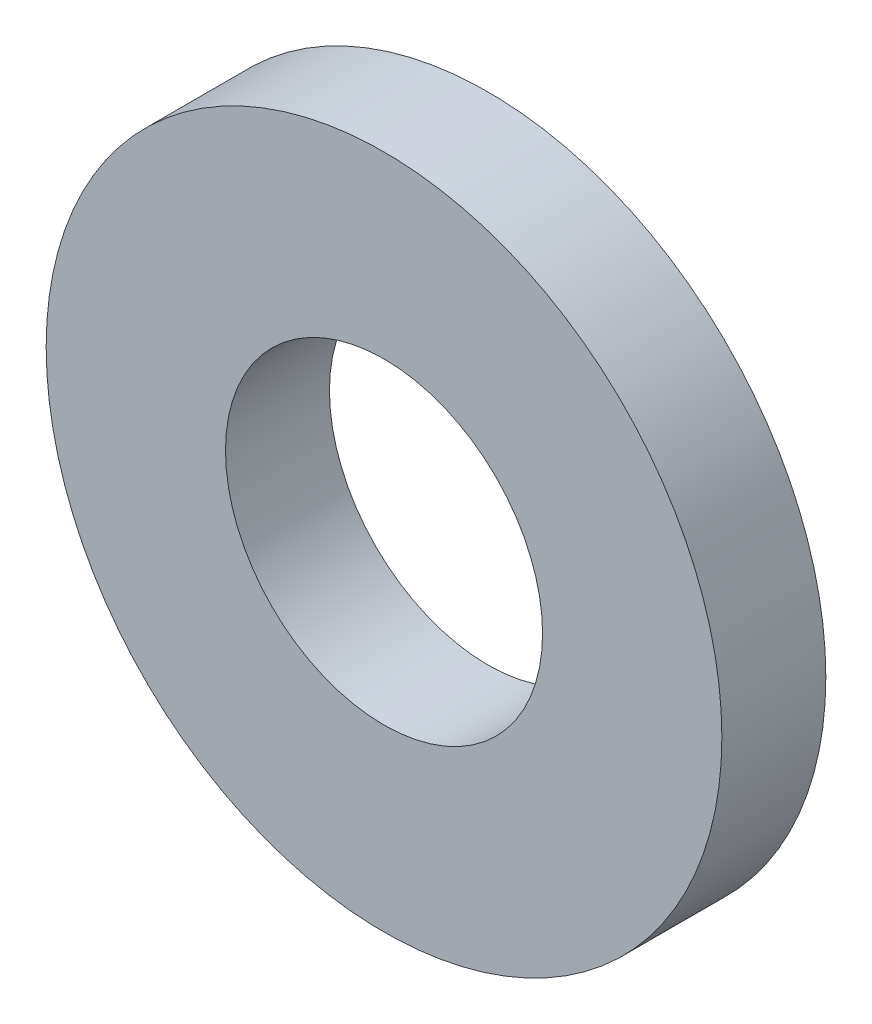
ISO-10303-21;
HEADER;
FILE_DESCRIPTION(('STEP AP214'),'2;1');
FILE_NAME('part.step','',(''),(''),'','','');
FILE_SCHEMA(('AUTOMOTIVE_DESIGN { 1 0 10303 214 1 1 1 1 }'));
ENDSEC;
DATA;
#1=APPLICATION_CONTEXT('core data for automotive mechanical design processes');
#2=APPLICATION_PROTOCOL_DEFINITION('international standard','automotive_design',2000,#1);
#3=PRODUCT_CONTEXT('',#1,'mechanical');
#4=PRODUCT('Part','Part','',(#3));
#5=PRODUCT_RELATED_PRODUCT_CATEGORY('part','',(#4));
#6=PRODUCT_DEFINITION_FORMATION('','',#4);
#7=PRODUCT_DEFINITION_CONTEXT('part definition',#1,'design');
#8=PRODUCT_DEFINITION('design','',#6,#7);
#9=PRODUCT_DEFINITION_SHAPE('','',#8);
#10=(LENGTH_UNIT() NAMED_UNIT(*) SI_UNIT(.MILLI.,.METRE.));
#11=(NAMED_UNIT(*) PLANE_ANGLE_UNIT() SI_UNIT($,.RADIAN.));
#12=(NAMED_UNIT(*) SI_UNIT($,.STERADIAN.) SOLID_ANGLE_UNIT());
#13=UNCERTAINTY_MEASURE_WITH_UNIT(LENGTH_MEASURE(1.E-05),#10,'distance_accuracy_value','');
#14=(GEOMETRIC_REPRESENTATION_CONTEXT(3) GLOBAL_UNCERTAINTY_ASSIGNED_CONTEXT((#13)) GLOBAL_UNIT_ASSIGNED_CONTEXT((#10,
#11,#12)) REPRESENTATION_CONTEXT('',''));
#15=CARTESIAN_POINT('',(0.,0.,0.));
#16=DIRECTION('',(0.,0.,1.));
#17=DIRECTION('',(1.,0.,0.));
#18=AXIS2_PLACEMENT_3D('',#15,#16,#17);
#19=CARTESIAN_POINT('',(0.,0.,4.));
#20=DIRECTION('',(0.,0.,1.));
#21=DIRECTION('',(1.,0.,0.));
#22=AXIS2_PLACEMENT_3D('',#19,#20,#21);
#23=PLANE('',#22);
#24=CARTESIAN_POINT('',(0.,0.,4.));
#25=DIRECTION('',(0.,0.,1.));
#26=DIRECTION('',(1.,0.,0.));
#27=AXIS2_PLACEMENT_3D('',#24,#25,#26);
#28=CIRCLE('',#27,6.1);
#29=CARTESIAN_POINT('',(6.1,0.,4.));
#30=VERTEX_POINT('',#29);
#31=EDGE_CURVE('E26',#30,#30,#28,.F.);
#32=ORIENTED_EDGE('',*,*,#31,.T.);
#33=EDGE_LOOP('',(#32));
#34=FACE_BOUND('',#33,.T.);
#35=CARTESIAN_POINT('',(0.,0.,4.));
#36=DIRECTION('',(0.,0.,1.));
#37=DIRECTION('',(1.,0.,0.));
#38=AXIS2_PLACEMENT_3D('',#35,#36,#37);
#39=CIRCLE('',#38,13.);
#40=CARTESIAN_POINT('',(13.,0.,4.));
#41=VERTEX_POINT('',#40);
#42=EDGE_CURVE('E17',#41,#41,#39,.F.);
#43=ORIENTED_EDGE('',*,*,#42,.F.);
#44=EDGE_LOOP('',(#43));
#45=FACE_BOUND('',#44,.T.);
#46=ADVANCED_FACE('F14',(#34,#45),#23,.T.);
#47=CARTESIAN_POINT('',(0.,0.,2.));
#48=DIRECTION('',(0.,0.,1.));
#49=DIRECTION('',(1.,0.,0.));
#50=AXIS2_PLACEMENT_3D('',#47,#48,#49);
#51=CYLINDRICAL_SURFACE('',#50,13.);
#52=CARTESIAN_POINT('',(0.,0.,0.));
#53=DIRECTION('',(0.,0.,1.));
#54=DIRECTION('',(1.,0.,0.));
#55=AXIS2_PLACEMENT_3D('',#52,#53,#54);
#56=CIRCLE('',#55,13.);
#57=CARTESIAN_POINT('',(13.,0.,0.));
#58=VERTEX_POINT('',#57);
#59=EDGE_CURVE('E21',#58,#58,#56,.T.);
#60=ORIENTED_EDGE('',*,*,#59,.T.);
#61=EDGE_LOOP('',(#60));
#62=FACE_BOUND('',#61,.T.);
#63=ORIENTED_EDGE('',*,*,#42,.T.);
#64=EDGE_LOOP('',(#63));
#65=FACE_BOUND('',#64,.T.);
#66=ADVANCED_FACE('F34',(#62,#65),#51,.T.);
#67=CARTESIAN_POINT('',(0.,0.,2.));
#68=DIRECTION('',(0.,0.,1.));
#69=DIRECTION('',(1.,0.,0.));
#70=AXIS2_PLACEMENT_3D('',#67,#68,#69);
#71=CYLINDRICAL_SURFACE('',#70,6.1);
#72=CARTESIAN_POINT('',(0.,0.,0.));
#73=DIRECTION('',(0.,0.,1.));
#74=DIRECTION('',(1.,0.,0.));
#75=AXIS2_PLACEMENT_3D('',#72,#73,#74);
#76=CIRCLE('',#75,6.1);
#77=CARTESIAN_POINT('',(6.1,0.,0.));
#78=VERTEX_POINT('',#77);
#79=EDGE_CURVE('E10',#78,#78,#76,.F.);
#80=ORIENTED_EDGE('',*,*,#79,.T.);
#81=EDGE_LOOP('',(#80));
#82=FACE_BOUND('',#81,.T.);
#83=ORIENTED_EDGE('',*,*,#31,.F.);
#84=EDGE_LOOP('',(#83));
#85=FACE_BOUND('',#84,.T.);
#86=ADVANCED_FACE('F41',(#82,#85),#71,.F.);
#87=CARTESIAN_POINT('',(0.,0.,0.));
#88=DIRECTION('',(0.,0.,1.));
#89=DIRECTION('',(1.,0.,0.));
#90=AXIS2_PLACEMENT_3D('',#87,#88,#89);
#91=PLANE('',#90);
#92=ORIENTED_EDGE('',*,*,#79,.F.);
#93=EDGE_LOOP('',(#92));
#94=FACE_BOUND('',#93,.T.);
#95=ORIENTED_EDGE('',*,*,#59,.F.);
#96=EDGE_LOOP('',(#95));
#97=FACE_BOUND('',#96,.T.);
#98=ADVANCED_FACE('F43',(#94,#97),#91,.F.);
#99=CLOSED_SHELL('',(#46,#66,#86,#98));
#100=MANIFOLD_SOLID_BREP('B1',#99);
#101=ADVANCED_BREP_SHAPE_REPRESENTATION('',(#18,#100),#14);
#102=SHAPE_DEFINITION_REPRESENTATION(#9,#101);
ENDSEC;
END-ISO-10303-21;
